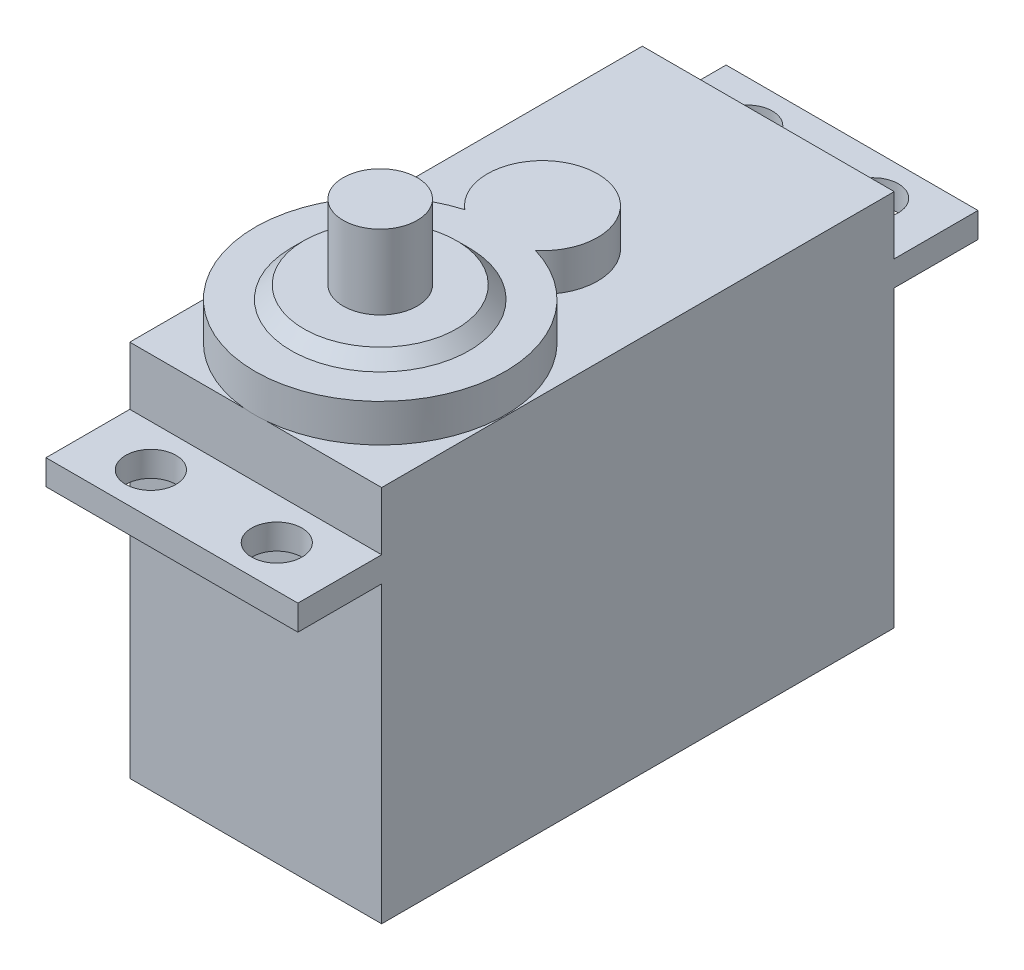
from build123d import *

# Parameters (mm, degrees)
SKETCH1_W                    = 54
SKETCH1_H                    = 30
BOSS_EXTRUDE1_DEPTH          = 20
SKETCH2_W                    = 6.65
SKETCH2_H                    = 4.62152028
CUT_EXTRUDE1_DEPTH           = 37.796738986
BOSS_EXTRUDE2_DEPTH          = 3
SKETCH4_W                    = 6.65
SKETCH4_H                    = 23.37847972
CUT_EXTRUDE2_DEPTH           = 39.118237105
SKETCH5_W                    = 6.65
SKETCH5_H                    = 4.62152028
CUT_EXTRUDE3_DEPTH           = 39.118237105
SKETCH6_W                    = 6.65
SKETCH6_H                    = 23.37847972
CUT_EXTRUDE4_DEPTH           = 39.118237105
F_4_0_4_DIAMETER_HOLE1_D     = 4
F_4_0_4_DIAMETER_HOLE1_DEPTH = 25.37847972


with BuildPart() as part:
    # Sketch1 → Boss-Extrude1 (new body)
    with BuildSketch(Plane(origin=(10, 0, 0), x_dir=(0, 0, -1), z_dir=(1, 0, 0))):
        Rectangle(SKETCH1_W, SKETCH1_H)
    extrude(amount=-BOSS_EXTRUDE1_DEPTH)

    # Sketch2 → Cut-Extrude1 (cut, through all)
    with BuildSketch(Plane.ZY.offset(10)):
        with Locations((23.675, 12.68923986)):
            Rectangle(SKETCH2_W, SKETCH2_H)
    extrude(amount=-CUT_EXTRUDE1_DEPTH, mode=Mode.SUBTRACT)

    # Sketch3 → Boss-Extrude2 (add)
    with BuildSketch(Plane(origin=(0, 15, 0), x_dir=(-1, 0, 0), z_dir=(0, 1, 0))):
        with BuildLine():
            ThreePointArc((2.806463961, 0.940843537), (9e-09, -6.799323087), (-2.806463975, 0.940843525))
            ThreePointArc((-2.806463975, 0.940843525), (-4.8e-08, 20.391667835), (2.806463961, 0.940843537))
        make_face()
    extrude(amount=BOSS_EXTRUDE2_DEPTH)

    # Sketch4 → Cut-Extrude2 (cut, through all)
    with BuildSketch(Plane.ZY.offset(10)):
        with Locations((-23.675, -3.31076014)):
            Rectangle(SKETCH4_W, SKETCH4_H)
    extrude(amount=-CUT_EXTRUDE2_DEPTH, mode=Mode.SUBTRACT)

    # Sketch5 → Cut-Extrude3 (cut, through all)
    with BuildSketch(Plane.ZY.offset(10)):
        with Locations((-23.675, 12.68923986)):
            Rectangle(SKETCH5_W, SKETCH5_H)
    extrude(amount=-CUT_EXTRUDE3_DEPTH, mode=Mode.SUBTRACT)

    # Sketch6 → Cut-Extrude4 (cut, through all)
    with BuildSketch(Plane.ZY.offset(10)):
        with Locations((23.675, -3.31076014)):
            Rectangle(SKETCH6_W, SKETCH6_H)
    extrude(amount=-CUT_EXTRUDE4_DEPTH, mode=Mode.SUBTRACT)

    # Sketch7 → Revolve1 (revolve)
    with BuildSketch(Plane(origin=(0, 0, 10.463790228), x_dir=(-1, 0, 0), z_dir=(0, 0, -1)), mode=Mode.PRIVATE) as revolve1_sk:
        Polygon((-7.067316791, 18), (0, 18), (0, 24.9), (-2.938711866, 24.9), (-2.938711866, 19), (-6.067316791, 19), align=None)
    revolve(revolve1_sk.sketch.rotate(Axis((0, 18, 10.463790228), (0, 1, 0)), 180), axis=Axis((0, 18, 10.463790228), (0, 1, 0)))

    # 4.0 _4_ Diameter Hole1
    with Locations(Plane(origin=(0, 10.37847972, 0), x_dir=(1, 0, 0), z_dir=(0, 1, 0))):
        with Locations((-5, 23.675), (5, 23.675), (5, -23.675), (-5, -23.675)):
            Hole(F_4_0_4_DIAMETER_HOLE1_D / 2, depth=F_4_0_4_DIAMETER_HOLE1_DEPTH)


solid = part.part
